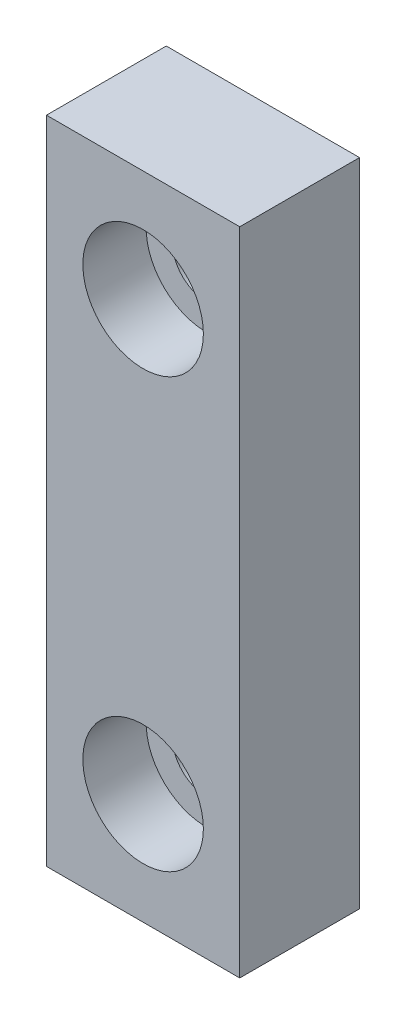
ISO-10303-21;
HEADER;
FILE_DESCRIPTION(('STEP AP214'),'2;1');
FILE_NAME('part.step','',(''),(''),'','','');
FILE_SCHEMA(('AUTOMOTIVE_DESIGN { 1 0 10303 214 1 1 1 1 }'));
ENDSEC;
DATA;
#1=APPLICATION_CONTEXT('core data for automotive mechanical design processes');
#2=APPLICATION_PROTOCOL_DEFINITION('international standard','automotive_design',2000,#1);
#3=PRODUCT_CONTEXT('',#1,'mechanical');
#4=PRODUCT('Part','Part','',(#3));
#5=PRODUCT_RELATED_PRODUCT_CATEGORY('part','',(#4));
#6=PRODUCT_DEFINITION_FORMATION('','',#4);
#7=PRODUCT_DEFINITION_CONTEXT('part definition',#1,'design');
#8=PRODUCT_DEFINITION('design','',#6,#7);
#9=PRODUCT_DEFINITION_SHAPE('','',#8);
#10=(LENGTH_UNIT() NAMED_UNIT(*) SI_UNIT(.MILLI.,.METRE.));
#11=(NAMED_UNIT(*) PLANE_ANGLE_UNIT() SI_UNIT($,.RADIAN.));
#12=(NAMED_UNIT(*) SI_UNIT($,.STERADIAN.) SOLID_ANGLE_UNIT());
#13=UNCERTAINTY_MEASURE_WITH_UNIT(LENGTH_MEASURE(1.E-05),#10,'distance_accuracy_value','');
#14=(GEOMETRIC_REPRESENTATION_CONTEXT(3) GLOBAL_UNCERTAINTY_ASSIGNED_CONTEXT((#13)) GLOBAL_UNIT_ASSIGNED_CONTEXT((#10,
#11,#12)) REPRESENTATION_CONTEXT('',''));
#15=CARTESIAN_POINT('',(0.,0.,0.));
#16=DIRECTION('',(0.,0.,1.));
#17=DIRECTION('',(1.,0.,0.));
#18=AXIS2_PLACEMENT_3D('',#15,#16,#17);
#19=CARTESIAN_POINT('',(-6.4135,21.59,3.9751));
#20=DIRECTION('',(1.,0.,0.));
#21=DIRECTION('',(0.,1.,0.));
#22=AXIS2_PLACEMENT_3D('',#19,#20,#21);
#23=PLANE('',#22);
#24=DIRECTION('',(0.,-1.,0.));
#25=VECTOR('',#24,1.);
#26=CARTESIAN_POINT('',(-6.4135,21.59,-3.9751));
#27=LINE('',#26,#25);
#28=CARTESIAN_POINT('',(-6.4135,21.59,-3.9751));
#29=VERTEX_POINT('',#28);
#30=CARTESIAN_POINT('',(-6.4135,-21.59,-3.9751));
#31=VERTEX_POINT('',#30);
#32=EDGE_CURVE('E96',#29,#31,#27,.T.);
#33=ORIENTED_EDGE('',*,*,#32,.T.);
#34=DIRECTION('',(0.,0.,-1.));
#35=VECTOR('',#34,1.);
#36=CARTESIAN_POINT('',(-6.4135,-21.59,3.9751));
#37=LINE('',#36,#35);
#38=CARTESIAN_POINT('',(-6.4135,-21.59,3.9751));
#39=VERTEX_POINT('',#38);
#40=EDGE_CURVE('E11',#39,#31,#37,.T.);
#41=ORIENTED_EDGE('',*,*,#40,.F.);
#42=DIRECTION('',(0.,-1.,0.));
#43=VECTOR('',#42,1.);
#44=CARTESIAN_POINT('',(-6.4135,21.59,3.9751));
#45=LINE('',#44,#43);
#46=CARTESIAN_POINT('',(-6.4135,21.59,3.9751));
#47=VERTEX_POINT('',#46);
#48=EDGE_CURVE('E84',#47,#39,#45,.T.);
#49=ORIENTED_EDGE('',*,*,#48,.F.);
#50=DIRECTION('',(0.,0.,-1.));
#51=VECTOR('',#50,1.);
#52=CARTESIAN_POINT('',(-6.4135,21.59,3.9751));
#53=LINE('',#52,#51);
#54=EDGE_CURVE('E92',#47,#29,#53,.T.);
#55=ORIENTED_EDGE('',*,*,#54,.T.);
#56=EDGE_LOOP('',(#33,#41,#49,#55));
#57=FACE_BOUND('',#56,.T.);
#58=ADVANCED_FACE('F33',(#57),#23,.F.);
#59=CARTESIAN_POINT('',(-6.4135,-21.59,3.9751));
#60=DIRECTION('',(0.,1.,0.));
#61=DIRECTION('',(0.,0.,1.));
#62=AXIS2_PLACEMENT_3D('',#59,#60,#61);
#63=PLANE('',#62);
#64=DIRECTION('',(1.,0.,0.));
#65=VECTOR('',#64,1.);
#66=CARTESIAN_POINT('',(-6.4135,-21.59,-3.9751));
#67=LINE('',#66,#65);
#68=CARTESIAN_POINT('',(6.4135,-21.59,-3.9751));
#69=VERTEX_POINT('',#68);
#70=EDGE_CURVE('E88',#31,#69,#67,.T.);
#71=ORIENTED_EDGE('',*,*,#70,.T.);
#72=DIRECTION('',(0.,0.,-1.));
#73=VECTOR('',#72,1.);
#74=CARTESIAN_POINT('',(6.4135,-21.59,3.9751));
#75=LINE('',#74,#73);
#76=CARTESIAN_POINT('',(6.4135,-21.59,3.9751));
#77=VERTEX_POINT('',#76);
#78=EDGE_CURVE('E41',#77,#69,#75,.T.);
#79=ORIENTED_EDGE('',*,*,#78,.F.);
#80=DIRECTION('',(1.,0.,0.));
#81=VECTOR('',#80,1.);
#82=CARTESIAN_POINT('',(-6.4135,-21.59,3.9751));
#83=LINE('',#82,#81);
#84=EDGE_CURVE('E79',#39,#77,#83,.T.);
#85=ORIENTED_EDGE('',*,*,#84,.F.);
#86=ORIENTED_EDGE('',*,*,#40,.T.);
#87=EDGE_LOOP('',(#71,#79,#85,#86));
#88=FACE_BOUND('',#87,.T.);
#89=ADVANCED_FACE('F87',(#88),#63,.F.);
#90=CARTESIAN_POINT('',(6.4135,21.59,3.9751));
#91=DIRECTION('',(-1.,0.,0.));
#92=DIRECTION('',(0.,-1.,0.));
#93=AXIS2_PLACEMENT_3D('',#90,#91,#92);
#94=PLANE('',#93);
#95=DIRECTION('',(0.,1.,0.));
#96=VECTOR('',#95,1.);
#97=CARTESIAN_POINT('',(6.4135,21.59,-3.9751));
#98=LINE('',#97,#96);
#99=CARTESIAN_POINT('',(6.4135,21.59,-3.9751));
#100=VERTEX_POINT('',#99);
#101=EDGE_CURVE('E66',#69,#100,#98,.T.);
#102=ORIENTED_EDGE('',*,*,#101,.T.);
#103=DIRECTION('',(0.,0.,-1.));
#104=VECTOR('',#103,1.);
#105=CARTESIAN_POINT('',(6.4135,21.59,3.9751));
#106=LINE('',#105,#104);
#107=CARTESIAN_POINT('',(6.4135,21.59,3.9751));
#108=VERTEX_POINT('',#107);
#109=EDGE_CURVE('E89',#108,#100,#106,.T.);
#110=ORIENTED_EDGE('',*,*,#109,.F.);
#111=DIRECTION('',(0.,1.,0.));
#112=VECTOR('',#111,1.);
#113=CARTESIAN_POINT('',(6.4135,21.59,3.9751));
#114=LINE('',#113,#112);
#115=EDGE_CURVE('E82',#77,#108,#114,.T.);
#116=ORIENTED_EDGE('',*,*,#115,.F.);
#117=ORIENTED_EDGE('',*,*,#78,.T.);
#118=EDGE_LOOP('',(#102,#110,#116,#117));
#119=FACE_BOUND('',#118,.T.);
#120=ADVANCED_FACE('F90',(#119),#94,.F.);
#121=CARTESIAN_POINT('',(-6.4135,21.59,3.9751));
#122=DIRECTION('',(0.,-1.,0.));
#123=DIRECTION('',(0.,0.,-1.));
#124=AXIS2_PLACEMENT_3D('',#121,#122,#123);
#125=PLANE('',#124);
#126=DIRECTION('',(-1.,0.,0.));
#127=VECTOR('',#126,1.);
#128=CARTESIAN_POINT('',(-6.4135,21.59,-3.9751));
#129=LINE('',#128,#127);
#130=EDGE_CURVE('E72',#100,#29,#129,.T.);
#131=ORIENTED_EDGE('',*,*,#130,.T.);
#132=ORIENTED_EDGE('',*,*,#54,.F.);
#133=DIRECTION('',(-1.,0.,0.));
#134=VECTOR('',#133,1.);
#135=CARTESIAN_POINT('',(-6.4135,21.59,3.9751));
#136=LINE('',#135,#134);
#137=EDGE_CURVE('E49',#108,#47,#136,.T.);
#138=ORIENTED_EDGE('',*,*,#137,.F.);
#139=ORIENTED_EDGE('',*,*,#109,.T.);
#140=EDGE_LOOP('',(#131,#132,#138,#139));
#141=FACE_BOUND('',#140,.T.);
#142=ADVANCED_FACE('F104',(#141),#125,.F.);
#143=CARTESIAN_POINT('',(-6.4135,-21.59,3.9751));
#144=DIRECTION('',(0.,0.,1.));
#145=DIRECTION('',(1.,0.,0.));
#146=AXIS2_PLACEMENT_3D('',#143,#144,#145);
#147=PLANE('',#146);
#148=CARTESIAN_POINT('',(0.,14.224,3.9751));
#149=DIRECTION('',(0.,0.,1.));
#150=DIRECTION('',(1.,0.,0.));
#151=AXIS2_PLACEMENT_3D('',#148,#149,#150);
#152=CIRCLE('',#151,4.);
#153=CARTESIAN_POINT('',(4.,14.224,3.9751));
#154=VERTEX_POINT('',#153);
#155=EDGE_CURVE('E121',#154,#154,#152,.T.);
#156=ORIENTED_EDGE('',*,*,#155,.F.);
#157=EDGE_LOOP('',(#156));
#158=FACE_BOUND('',#157,.T.);
#159=CARTESIAN_POINT('',(0.,-14.224,3.9751));
#160=DIRECTION('',(0.,0.,1.));
#161=DIRECTION('',(1.,0.,0.));
#162=AXIS2_PLACEMENT_3D('',#159,#160,#161);
#163=CIRCLE('',#162,4.);
#164=CARTESIAN_POINT('',(4.,-14.224,3.9751));
#165=VERTEX_POINT('',#164);
#166=EDGE_CURVE('E99',#165,#165,#163,.T.);
#167=ORIENTED_EDGE('',*,*,#166,.F.);
#168=EDGE_LOOP('',(#167));
#169=FACE_BOUND('',#168,.T.);
#170=ORIENTED_EDGE('',*,*,#48,.T.);
#171=ORIENTED_EDGE('',*,*,#84,.T.);
#172=ORIENTED_EDGE('',*,*,#115,.T.);
#173=ORIENTED_EDGE('',*,*,#137,.T.);
#174=EDGE_LOOP('',(#170,#171,#172,#173));
#175=FACE_BOUND('',#174,.T.);
#176=ADVANCED_FACE('F80',(#158,#169,#175),#147,.T.);
#177=CARTESIAN_POINT('',(-6.4135,-21.59,-3.9751));
#178=DIRECTION('',(0.,0.,1.));
#179=DIRECTION('',(1.,0.,0.));
#180=AXIS2_PLACEMENT_3D('',#177,#178,#179);
#181=PLANE('',#180);
#182=CARTESIAN_POINT('',(0.,14.224,-3.9751));
#183=DIRECTION('',(0.,0.,1.));
#184=DIRECTION('',(1.,0.,0.));
#185=AXIS2_PLACEMENT_3D('',#182,#183,#184);
#186=CIRCLE('',#185,2.25);
#187=CARTESIAN_POINT('',(2.25,14.224,-3.9751));
#188=VERTEX_POINT('',#187);
#189=EDGE_CURVE('E130',#188,#188,#186,.T.);
#190=ORIENTED_EDGE('',*,*,#189,.T.);
#191=EDGE_LOOP('',(#190));
#192=FACE_BOUND('',#191,.T.);
#193=CARTESIAN_POINT('',(0.,-14.224,-3.9751));
#194=DIRECTION('',(0.,0.,1.));
#195=DIRECTION('',(1.,0.,0.));
#196=AXIS2_PLACEMENT_3D('',#193,#194,#195);
#197=CIRCLE('',#196,2.25);
#198=CARTESIAN_POINT('',(2.25,-14.224,-3.9751));
#199=VERTEX_POINT('',#198);
#200=EDGE_CURVE('E118',#199,#199,#197,.T.);
#201=ORIENTED_EDGE('',*,*,#200,.T.);
#202=EDGE_LOOP('',(#201));
#203=FACE_BOUND('',#202,.T.);
#204=ORIENTED_EDGE('',*,*,#32,.F.);
#205=ORIENTED_EDGE('',*,*,#130,.F.);
#206=ORIENTED_EDGE('',*,*,#101,.F.);
#207=ORIENTED_EDGE('',*,*,#70,.F.);
#208=EDGE_LOOP('',(#204,#205,#206,#207));
#209=FACE_BOUND('',#208,.T.);
#210=ADVANCED_FACE('F107',(#192,#203,#209),#181,.F.);
#211=CARTESIAN_POINT('',(0.,-14.224,3.9751));
#212=DIRECTION('',(0.,0.,1.));
#213=DIRECTION('',(1.,0.,0.));
#214=AXIS2_PLACEMENT_3D('',#211,#212,#213);
#215=CYLINDRICAL_SURFACE('',#214,4.);
#216=CARTESIAN_POINT('',(0.,-14.224,-0.224900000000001));
#217=DIRECTION('',(0.,0.,1.));
#218=DIRECTION('',(1.,0.,0.));
#219=AXIS2_PLACEMENT_3D('',#216,#217,#218);
#220=CIRCLE('',#219,4.);
#221=CARTESIAN_POINT('',(4.,-14.224,-0.224900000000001));
#222=VERTEX_POINT('',#221);
#223=EDGE_CURVE('E112',#222,#222,#220,.T.);
#224=ORIENTED_EDGE('',*,*,#223,.F.);
#225=EDGE_LOOP('',(#224));
#226=FACE_BOUND('',#225,.T.);
#227=ORIENTED_EDGE('',*,*,#166,.T.);
#228=EDGE_LOOP('',(#227));
#229=FACE_BOUND('',#228,.T.);
#230=ADVANCED_FACE('F160',(#226,#229),#215,.F.);
#231=CARTESIAN_POINT('',(2.25,-14.224,-0.224900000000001));
#232=DIRECTION('',(0.,0.,-1.));
#233=DIRECTION('',(-1.,0.,0.));
#234=AXIS2_PLACEMENT_3D('',#231,#232,#233);
#235=PLANE('',#234);
#236=CARTESIAN_POINT('',(0.,-14.224,-0.224900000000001));
#237=DIRECTION('',(0.,0.,1.));
#238=DIRECTION('',(1.,0.,0.));
#239=AXIS2_PLACEMENT_3D('',#236,#237,#238);
#240=CIRCLE('',#239,2.25);
#241=CARTESIAN_POINT('',(2.25,-14.224,-0.224900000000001));
#242=VERTEX_POINT('',#241);
#243=EDGE_CURVE('E115',#242,#242,#240,.T.);
#244=ORIENTED_EDGE('',*,*,#243,.F.);
#245=EDGE_LOOP('',(#244));
#246=FACE_BOUND('',#245,.T.);
#247=ORIENTED_EDGE('',*,*,#223,.T.);
#248=EDGE_LOOP('',(#247));
#249=FACE_BOUND('',#248,.T.);
#250=ADVANCED_FACE('F162',(#246,#249),#235,.F.);
#251=CARTESIAN_POINT('',(0.,-14.224,3.9751));
#252=DIRECTION('',(0.,0.,1.));
#253=DIRECTION('',(1.,0.,0.));
#254=AXIS2_PLACEMENT_3D('',#251,#252,#253);
#255=CYLINDRICAL_SURFACE('',#254,2.25);
#256=ORIENTED_EDGE('',*,*,#200,.F.);
#257=EDGE_LOOP('',(#256));
#258=FACE_BOUND('',#257,.T.);
#259=ORIENTED_EDGE('',*,*,#243,.T.);
#260=EDGE_LOOP('',(#259));
#261=FACE_BOUND('',#260,.T.);
#262=ADVANCED_FACE('F151',(#258,#261),#255,.F.);
#263=CARTESIAN_POINT('',(0.,14.224,3.9751));
#264=DIRECTION('',(0.,0.,1.));
#265=DIRECTION('',(1.,0.,0.));
#266=AXIS2_PLACEMENT_3D('',#263,#264,#265);
#267=CYLINDRICAL_SURFACE('',#266,4.);
#268=CARTESIAN_POINT('',(0.,14.224,-0.224900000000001));
#269=DIRECTION('',(0.,0.,1.));
#270=DIRECTION('',(1.,0.,0.));
#271=AXIS2_PLACEMENT_3D('',#268,#269,#270);
#272=CIRCLE('',#271,4.);
#273=CARTESIAN_POINT('',(4.,14.224,-0.224900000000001));
#274=VERTEX_POINT('',#273);
#275=EDGE_CURVE('E124',#274,#274,#272,.T.);
#276=ORIENTED_EDGE('',*,*,#275,.F.);
#277=EDGE_LOOP('',(#276));
#278=FACE_BOUND('',#277,.T.);
#279=ORIENTED_EDGE('',*,*,#155,.T.);
#280=EDGE_LOOP('',(#279));
#281=FACE_BOUND('',#280,.T.);
#282=ADVANCED_FACE('F145',(#278,#281),#267,.F.);
#283=CARTESIAN_POINT('',(2.25,14.224,-0.224900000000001));
#284=DIRECTION('',(0.,0.,-1.));
#285=DIRECTION('',(-1.,0.,0.));
#286=AXIS2_PLACEMENT_3D('',#283,#284,#285);
#287=PLANE('',#286);
#288=CARTESIAN_POINT('',(0.,14.224,-0.224900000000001));
#289=DIRECTION('',(0.,0.,1.));
#290=DIRECTION('',(1.,0.,0.));
#291=AXIS2_PLACEMENT_3D('',#288,#289,#290);
#292=CIRCLE('',#291,2.25);
#293=CARTESIAN_POINT('',(2.25,14.224,-0.224900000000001));
#294=VERTEX_POINT('',#293);
#295=EDGE_CURVE('E127',#294,#294,#292,.T.);
#296=ORIENTED_EDGE('',*,*,#295,.F.);
#297=EDGE_LOOP('',(#296));
#298=FACE_BOUND('',#297,.T.);
#299=ORIENTED_EDGE('',*,*,#275,.T.);
#300=EDGE_LOOP('',(#299));
#301=FACE_BOUND('',#300,.T.);
#302=ADVANCED_FACE('F139',(#298,#301),#287,.F.);
#303=CARTESIAN_POINT('',(0.,14.224,3.9751));
#304=DIRECTION('',(0.,0.,1.));
#305=DIRECTION('',(1.,0.,0.));
#306=AXIS2_PLACEMENT_3D('',#303,#304,#305);
#307=CYLINDRICAL_SURFACE('',#306,2.25);
#308=ORIENTED_EDGE('',*,*,#189,.F.);
#309=EDGE_LOOP('',(#308));
#310=FACE_BOUND('',#309,.T.);
#311=ORIENTED_EDGE('',*,*,#295,.T.);
#312=EDGE_LOOP('',(#311));
#313=FACE_BOUND('',#312,.T.);
#314=ADVANCED_FACE('F136',(#310,#313),#307,.F.);
#315=CLOSED_SHELL('',(#58,#89,#120,#142,#176,#210,#230,#250,#262,#282,#302,#314));
#316=MANIFOLD_SOLID_BREP('B2',#315);
#317=ADVANCED_BREP_SHAPE_REPRESENTATION('',(#18,#316),#14);
#318=SHAPE_DEFINITION_REPRESENTATION(#9,#317);
ENDSEC;
END-ISO-10303-21;
